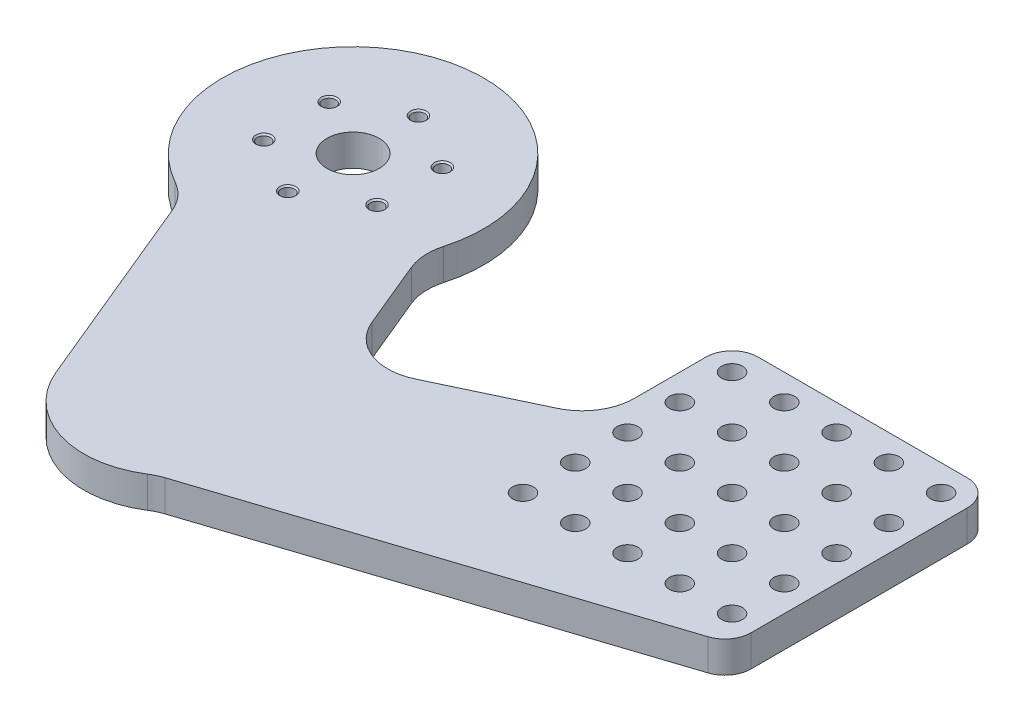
from build123d import *

# Parameters (mm, degrees)
BOSS_EXTRUDE1_DEPTH         = 6
SKETCH2_R                   = 2
CUT_EXTRUDE1_DEPTH          = 10
FILLET5_R                   = 5
FILLET6_R                   = 10
M3_TAPPED_HOLE1_D           = 2.5
M3_TAPPED_HOLE1_CSINK_D     = 3.05
M3_TAPPED_HOLE1_CSINK_ANGLE = 90
SKETCH7_R                   = 5
CUT_EXTRUDE2_DEPTH          = 20.7


with BuildPart() as part:
    # Sketch1 → Boss-Extrude1 (new body)
    with BuildSketch(Plane(origin=(0, 0, 0), x_dir=(1, 0, 0), z_dir=(0, 1, 0))):
        with BuildLine():
            Line((-101.835625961, -3.191508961), (-84.619992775, -44.753724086))
            ThreePointArc((-84.619992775, -44.753724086), (-73.170964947, -54.908539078), (-58.113250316, -52.176189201))
            Line((-58.113250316, -52.176189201), (25, -25))
            Line((25, -25), (25, 25))
            Line((25, 25), (-25, 25))
            Line((-25, 25), (-25, 0))
            Line((-25, 0), (-58.67491577, -15.931273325))
            Line((-58.67491577, -15.931273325), (-69.499842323, 10.202411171))
            ThreePointArc((-69.499842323, 10.202411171), (-102.067085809, 43.096988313), (-101.835625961, -3.191508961))
        make_face()
    extrude(amount=BOSS_EXTRUDE1_DEPTH)

    # Sketch2 → Cut-Extrude1 (cut)
    with BuildSketch(Plane(origin=(0, 6, 0), x_dir=(1, 0, 0), z_dir=(0, 1, 0))):
        with Locations(Location((-20, -20, 0), (0, 0, 270))):
            Circle(SKETCH2_R)
        with Locations(Location((-10, -20, 0), (0, 0, 270))):
            Circle(SKETCH2_R)
        with Locations(Location((0, -20, 0), (0, 0, 270))):
            Circle(SKETCH2_R)
        with Locations(Location((10, -20, 0), (0, 0, 270))):
            Circle(SKETCH2_R)
        with Locations(Location((20, -20, 0), (0, 0, 270))):
            Circle(SKETCH2_R)
        with Locations(Location((-10, -10, 0), (0, 0, 270))):
            Circle(SKETCH2_R)
        with Locations(Location((0, -10, 0), (0, 0, 270))):
            Circle(SKETCH2_R)
        with Locations(Location((10, -10, 0), (0, 0, 270))):
            Circle(SKETCH2_R)
        with Locations(Location((20, -10, 0), (0, 0, 270))):
            Circle(SKETCH2_R)
        with Locations(Location((-10, 0, 0), (0, 0, 270))):
            Circle(SKETCH2_R)
        with Locations(Location((0, 0, 0), (0, 0, 270))):
            Circle(SKETCH2_R)
        with Locations(Location((10, 0, 0), (0, 0, 270))):
            Circle(SKETCH2_R)
        with Locations(Location((20, 0, 0), (0, 0, 270))):
            Circle(SKETCH2_R)
        with Locations(Location((-10, 10, 0), (0, 0, 270))):
            Circle(SKETCH2_R)
        with Locations(Location((0, 10, 0), (0, 0, 270))):
            Circle(SKETCH2_R)
        with Locations(Location((10, 10, 0), (0, 0, 270))):
            Circle(SKETCH2_R)
        with Locations(Location((20, 10, 0), (0, 0, 270))):
            Circle(SKETCH2_R)
        with Locations(Location((-10, 20, 0), (0, 0, 270))):
            Circle(SKETCH2_R)
        with Locations(Location((0, 20, 0), (0, 0, 270))):
            Circle(SKETCH2_R)
        with Locations(Location((10, 20, 0), (0, 0, 270))):
            Circle(SKETCH2_R)
        with Locations(Location((20, 20, 0), (0, 0, 270))):
            Circle(SKETCH2_R)
        with Locations(Location((-20, -10, 0), (0, 0, 270))):
            Circle(SKETCH2_R)
        with Locations(Location((-20, 0, 0), (0, 0, 270))):
            Circle(SKETCH2_R)
        with Locations(Location((-20, 10, 0), (0, 0, 270))):
            Circle(SKETCH2_R)
        with Locations(Location((-20, 20, 0), (0, 0, 270))):
            Circle(SKETCH2_R)
    extrude(amount=-CUT_EXTRUDE1_DEPTH, mode=Mode.SUBTRACT)

    # Fillet5
    fillet5_edges = [part.edges().sort_by_distance(p)[0] for p in [
        (-25, 3, -25),
        (25, 3, -25),
        (25, 3, 25),
    ]]
    fillet(fillet5_edges, radius=FILLET5_R)

    # Fillet6
    fillet6_edges = [part.edges().sort_by_distance(p)[0] for p in [
        (-69.499842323, 3, -10.202411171),
        (-58.67491577, 3, 15.931273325),
        (-25, 3, 0),
        (-58.113250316, 3, 52.176189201),
        (-101.835625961, 3, 3.191508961),
    ]]
    fillet(fillet6_edges, radius=FILLET6_R)

    # M3 Tapped Hole1 (through all)
    with Locations(Plane(origin=(0, 6, 0), x_dir=(1, 0, 0), z_dir=(0, 1, 0))):
        with Locations((-103.325317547, 26.25), (-92.5, 32.5), (-81.674682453, 26.25), (-81.674682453, 13.75), (-92.5, 7.5), (-103.325317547, 13.75)):
            CounterSinkHole(M3_TAPPED_HOLE1_D / 2, M3_TAPPED_HOLE1_CSINK_D / 2, counter_sink_angle=M3_TAPPED_HOLE1_CSINK_ANGLE)

    # Sketch7 → Cut-Extrude2 (cut)
    with BuildSketch(Plane(origin=(0, 6, 0), x_dir=(1, 0, 0), z_dir=(0, 1, 0))):
        with Locations(Location((-92.5, 20, 0), (0, 0, 270))):
            Circle(SKETCH7_R)
    extrude(amount=-CUT_EXTRUDE2_DEPTH, mode=Mode.SUBTRACT)


solid = part.part
